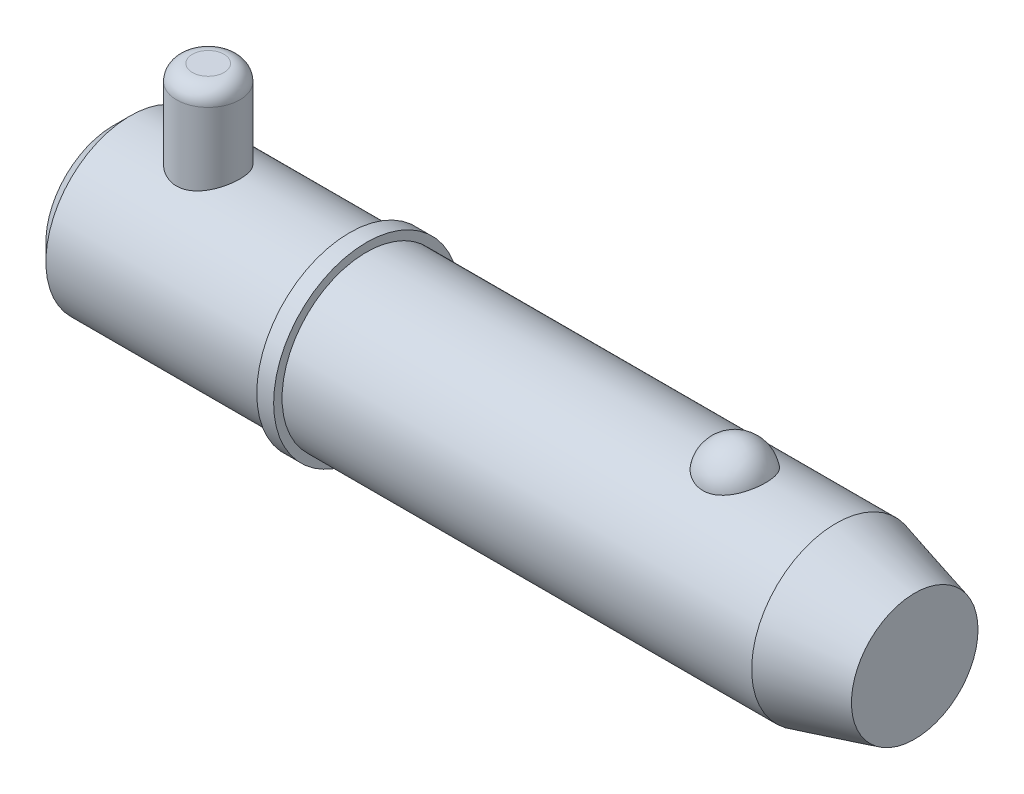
ISO-10303-21;
HEADER;
FILE_DESCRIPTION(('STEP AP214'),'2;1');
FILE_NAME('part.step','',(''),(''),'','','');
FILE_SCHEMA(('AUTOMOTIVE_DESIGN { 1 0 10303 214 1 1 1 1 }'));
ENDSEC;
DATA;
#1=APPLICATION_CONTEXT('core data for automotive mechanical design processes');
#2=APPLICATION_PROTOCOL_DEFINITION('international standard','automotive_design',2000,#1);
#3=PRODUCT_CONTEXT('',#1,'mechanical');
#4=PRODUCT('Part','Part','',(#3));
#5=PRODUCT_RELATED_PRODUCT_CATEGORY('part','',(#4));
#6=PRODUCT_DEFINITION_FORMATION('','',#4);
#7=PRODUCT_DEFINITION_CONTEXT('part definition',#1,'design');
#8=PRODUCT_DEFINITION('design','',#6,#7);
#9=PRODUCT_DEFINITION_SHAPE('','',#8);
#10=(LENGTH_UNIT() NAMED_UNIT(*) SI_UNIT(.MILLI.,.METRE.));
#11=(NAMED_UNIT(*) PLANE_ANGLE_UNIT() SI_UNIT($,.RADIAN.));
#12=(NAMED_UNIT(*) SI_UNIT($,.STERADIAN.) SOLID_ANGLE_UNIT());
#13=UNCERTAINTY_MEASURE_WITH_UNIT(LENGTH_MEASURE(1.E-05),#10,'distance_accuracy_value','');
#14=(GEOMETRIC_REPRESENTATION_CONTEXT(3) GLOBAL_UNCERTAINTY_ASSIGNED_CONTEXT((#13)) GLOBAL_UNIT_ASSIGNED_CONTEXT((#10,
#11,#12)) REPRESENTATION_CONTEXT('',''));
#15=CARTESIAN_POINT('',(0.,0.,0.));
#16=DIRECTION('',(0.,0.,1.));
#17=DIRECTION('',(1.,0.,0.));
#18=AXIS2_PLACEMENT_3D('',#15,#16,#17);
#19=CARTESIAN_POINT('',(14.28,25.4,0.));
#20=DIRECTION('',(0.,-1.,0.));
#21=DIRECTION('',(0.,0.,-1.));
#22=AXIS2_PLACEMENT_3D('',#19,#20,#21);
#23=CYLINDRICAL_SURFACE('',#22,4.76);
#24=CARTESIAN_POINT('',(14.28,-10.32,0.));
#25=DIRECTION('',(0.,1.,0.));
#26=DIRECTION('',(0.,0.,1.));
#27=AXIS2_PLACEMENT_3D('',#24,#25,#26);
#28=CIRCLE('',#27,4.76);
#29=CARTESIAN_POINT('',(14.28,-10.32,-4.76));
#30=VERTEX_POINT('',#29);
#31=EDGE_CURVE('P0_E25',#30,#30,#28,.T.);
#32=CARTESIAN_POINT('',(14.28,23.02,0.));
#33=DIRECTION('',(0.,1.,0.));
#34=DIRECTION('',(0.,0.,1.));
#35=AXIS2_PLACEMENT_3D('',#32,#33,#34);
#36=CIRCLE('',#35,4.76);
#37=CARTESIAN_POINT('',(14.28,23.02,-4.76));
#38=VERTEX_POINT('',#37);
#39=EDGE_CURVE('P0_E29',#38,#38,#36,.F.);
#40=CARTESIAN_POINT('',(14.28,-10.32,-4.76));
#41=CARTESIAN_POINT('',(14.28,-9.97270833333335,-4.76));
#42=CARTESIAN_POINT('',(14.28,-9.62541666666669,-4.76));
#43=CARTESIAN_POINT('',(14.28,-8.93083333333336,-4.76));
#44=CARTESIAN_POINT('',(14.28,-8.58354166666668,-4.76));
#45=CARTESIAN_POINT('',(14.28,-7.88895833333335,-4.76));
#46=CARTESIAN_POINT('',(14.28,-7.54166666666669,-4.76));
#47=CARTESIAN_POINT('',(14.28,-6.84708333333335,-4.76));
#48=CARTESIAN_POINT('',(14.28,-6.49979166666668,-4.76));
#49=CARTESIAN_POINT('',(14.28,-5.80520833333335,-4.76));
#50=CARTESIAN_POINT('',(14.28,-5.45791666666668,-4.76));
#51=CARTESIAN_POINT('',(14.28,-4.76333333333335,-4.76));
#52=CARTESIAN_POINT('',(14.28,-4.41604166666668,-4.76));
#53=CARTESIAN_POINT('',(14.28,-3.72145833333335,-4.76));
#54=CARTESIAN_POINT('',(14.28,-3.37416666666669,-4.76));
#55=CARTESIAN_POINT('',(14.28,-2.67958333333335,-4.76));
#56=CARTESIAN_POINT('',(14.28,-2.33229166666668,-4.76));
#57=CARTESIAN_POINT('',(14.28,-1.63770833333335,-4.76));
#58=CARTESIAN_POINT('',(14.28,-1.29041666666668,-4.76));
#59=CARTESIAN_POINT('',(14.28,-0.595833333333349,-4.76));
#60=CARTESIAN_POINT('',(14.28,-0.24854166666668,-4.76));
#61=CARTESIAN_POINT('',(14.28,0.446041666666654,-4.76));
#62=CARTESIAN_POINT('',(14.28,0.793333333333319,-4.76));
#63=CARTESIAN_POINT('',(14.28,1.48791666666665,-4.76));
#64=CARTESIAN_POINT('',(14.28,1.83520833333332,-4.76));
#65=CARTESIAN_POINT('',(14.28,2.52979166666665,-4.76));
#66=CARTESIAN_POINT('',(14.28,2.87708333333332,-4.76));
#67=CARTESIAN_POINT('',(14.28,3.57166666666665,-4.76));
#68=CARTESIAN_POINT('',(14.28,3.91895833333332,-4.76));
#69=CARTESIAN_POINT('',(14.28,4.61354166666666,-4.76));
#70=CARTESIAN_POINT('',(14.28,4.96083333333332,-4.76));
#71=CARTESIAN_POINT('',(14.28,5.65541666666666,-4.76));
#72=CARTESIAN_POINT('',(14.28,6.00270833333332,-4.76));
#73=CARTESIAN_POINT('',(14.28,6.69729166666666,-4.76));
#74=CARTESIAN_POINT('',(14.28,7.04458333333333,-4.76));
#75=CARTESIAN_POINT('',(14.28,7.73916666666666,-4.76));
#76=CARTESIAN_POINT('',(14.28,8.08645833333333,-4.76));
#77=CARTESIAN_POINT('',(14.28,8.78104166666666,-4.76));
#78=CARTESIAN_POINT('',(14.28,9.12833333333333,-4.76));
#79=CARTESIAN_POINT('',(14.28,9.82291666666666,-4.76));
#80=CARTESIAN_POINT('',(14.28,10.1702083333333,-4.76));
#81=CARTESIAN_POINT('',(14.28,10.8647916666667,-4.76));
#82=CARTESIAN_POINT('',(14.28,11.2120833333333,-4.76));
#83=CARTESIAN_POINT('',(14.28,11.9066666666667,-4.76));
#84=CARTESIAN_POINT('',(14.28,12.2539583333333,-4.76));
#85=CARTESIAN_POINT('',(14.28,12.9485416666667,-4.76));
#86=CARTESIAN_POINT('',(14.28,13.2958333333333,-4.76));
#87=CARTESIAN_POINT('',(14.28,13.9904166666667,-4.76));
#88=CARTESIAN_POINT('',(14.28,14.3377083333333,-4.76));
#89=CARTESIAN_POINT('',(14.28,15.0322916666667,-4.76));
#90=CARTESIAN_POINT('',(14.28,15.3795833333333,-4.76));
#91=CARTESIAN_POINT('',(14.28,16.0741666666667,-4.76));
#92=CARTESIAN_POINT('',(14.28,16.4214583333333,-4.76));
#93=CARTESIAN_POINT('',(14.28,17.1160416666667,-4.76));
#94=CARTESIAN_POINT('',(14.28,17.4633333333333,-4.76));
#95=CARTESIAN_POINT('',(14.28,18.1579166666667,-4.76));
#96=CARTESIAN_POINT('',(14.28,18.5052083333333,-4.76));
#97=CARTESIAN_POINT('',(14.28,19.1997916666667,-4.76));
#98=CARTESIAN_POINT('',(14.28,19.5470833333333,-4.76));
#99=CARTESIAN_POINT('',(14.28,20.2416666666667,-4.76));
#100=CARTESIAN_POINT('',(14.28,20.5889583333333,-4.76));
#101=CARTESIAN_POINT('',(14.28,21.2835416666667,-4.76));
#102=CARTESIAN_POINT('',(14.28,21.6308333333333,-4.76));
#103=CARTESIAN_POINT('',(14.28,22.3254166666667,-4.76));
#104=CARTESIAN_POINT('',(14.28,22.6727083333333,-4.76));
#105=CARTESIAN_POINT('',(14.28,23.02,-4.76));
#106=B_SPLINE_CURVE_WITH_KNOTS('',3,(#40,#41,#42,#43,#44,#45,#46,#47,#48,#49,#50,#51,#52,#53,
#54,#55,#56,#57,#58,#59,#60,#61,#62,#63,#64,#65,#66,#67,#68,#69,#70,#71,#72,#73,#74,#75,#76,#77,
#78,#79,#80,#81,#82,#83,#84,#85,#86,#87,#88,#89,#90,#91,#92,#93,#94,#95,#96,#97,#98,#99,#100,
#101,#102,#103,#104,#105),.UNSPECIFIED.,.F.,.F.,(4,2,2,2,2,2,2,2,2,2,2,2,2,2,2,2,2,2,2,2,2,2,2,
2,2,2,2,2,2,2,2,2,4),(0.,1.041875,2.08375,3.125625,4.1675,5.209375,6.25125,7.293125,
8.33500000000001,9.376875,10.41875,11.460625,12.5025,13.544375,14.58625,15.628125,16.67,
17.711875,18.75375,19.795625,20.8375,21.879375,22.92125,23.963125,25.005,26.046875,27.08875,
28.130625,29.1725,30.214375,31.25625,32.298125,33.34),.UNSPECIFIED.);
#107=EDGE_CURVE('P0_BSEAM14',#30,#38,#106,.T.);
#108=ORIENTED_EDGE('',*,*,#31,.T.);
#109=ORIENTED_EDGE('',*,*,#39,.T.);
#110=ORIENTED_EDGE('',*,*,#107,.T.);
#111=ORIENTED_EDGE('',*,*,#107,.F.);
#112=EDGE_LOOP('',(#108,#110,#109,#111));
#113=FACE_BOUND('',#112,.T.);
#114=ADVANCED_FACE('P0_F14',(#113),#23,.T.);
#115=CARTESIAN_POINT('',(14.28,25.4,0.));
#116=DIRECTION('',(0.,1.,0.));
#117=DIRECTION('',(0.,0.,1.));
#118=AXIS2_PLACEMENT_3D('',#115,#116,#117);
#119=PLANE('',#118);
#120=CARTESIAN_POINT('',(14.28,25.4,0.));
#121=DIRECTION('',(0.,1.,0.));
#122=DIRECTION('',(0.,0.,1.));
#123=AXIS2_PLACEMENT_3D('',#120,#121,#122);
#124=CIRCLE('',#123,2.38);
#125=CARTESIAN_POINT('',(14.28,25.4,2.38));
#126=VERTEX_POINT('',#125);
#127=EDGE_CURVE('P0_E10',#126,#126,#124,.T.);
#128=ORIENTED_EDGE('',*,*,#127,.T.);
#129=EDGE_LOOP('',(#128));
#130=FACE_BOUND('',#129,.T.);
#131=ADVANCED_FACE('P0_F46',(#130),#119,.T.);
#132=CARTESIAN_POINT('',(14.28,-12.7,0.));
#133=DIRECTION('',(0.,1.,0.));
#134=DIRECTION('',(0.,0.,1.));
#135=AXIS2_PLACEMENT_3D('',#132,#133,#134);
#136=PLANE('',#135);
#137=CARTESIAN_POINT('',(14.28,-12.7,0.));
#138=DIRECTION('',(0.,1.,0.));
#139=DIRECTION('',(0.,0.,1.));
#140=AXIS2_PLACEMENT_3D('',#137,#138,#139);
#141=CIRCLE('',#140,2.38);
#142=CARTESIAN_POINT('',(14.28,-12.7,2.38));
#143=VERTEX_POINT('',#142);
#144=EDGE_CURVE('P0_E21',#143,#143,#141,.F.);
#145=ORIENTED_EDGE('',*,*,#144,.T.);
#146=EDGE_LOOP('',(#145));
#147=FACE_BOUND('',#146,.T.);
#148=ADVANCED_FACE('P0_F43',(#147),#136,.F.);
#149=CARTESIAN_POINT('',(14.28,-10.32,0.));
#150=DIRECTION('',(0.,1.,0.));
#151=DIRECTION('',(0.,0.,1.));
#152=AXIS2_PLACEMENT_3D('',#149,#150,#151);
#153=DEGENERATE_TOROIDAL_SURFACE('',#152,2.38,2.38,.T.);
#154=ORIENTED_EDGE('',*,*,#144,.F.);
#155=EDGE_LOOP('',(#154));
#156=FACE_BOUND('',#155,.T.);
#157=ORIENTED_EDGE('',*,*,#31,.F.);
#158=EDGE_LOOP('',(#157));
#159=FACE_BOUND('',#158,.T.);
#160=ADVANCED_FACE('P0_F38',(#156,#159),#153,.T.);
#161=CARTESIAN_POINT('',(14.28,23.02,0.));
#162=DIRECTION('',(0.,1.,0.));
#163=DIRECTION('',(0.,0.,1.));
#164=AXIS2_PLACEMENT_3D('',#161,#162,#163);
#165=DEGENERATE_TOROIDAL_SURFACE('',#164,2.38,2.38,.T.);
#166=ORIENTED_EDGE('',*,*,#39,.F.);
#167=EDGE_LOOP('',(#166));
#168=FACE_BOUND('',#167,.T.);
#169=ORIENTED_EDGE('',*,*,#127,.F.);
#170=EDGE_LOOP('',(#169));
#171=FACE_BOUND('',#170,.T.);
#172=ADVANCED_FACE('P0_F16',(#168,#171),#165,.T.);
#173=CLOSED_SHELL('',(#114,#131,#148,#160,#172));
#174=MANIFOLD_SOLID_BREP('P0_B1',#173);
#175=CARTESIAN_POINT('',(0.,0.,0.));
#176=DIRECTION('',(1.,0.,0.));
#177=DIRECTION('',(0.,0.,-1.));
#178=AXIS2_PLACEMENT_3D('',#175,#176,#177);
#179=CYLINDRICAL_SURFACE('',#178,12.7);
#180=CARTESIAN_POINT('',(108.800738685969,0.,0.));
#181=DIRECTION('',(1.,0.,0.));
#182=DIRECTION('',(0.,0.,-1.));
#183=AXIS2_PLACEMENT_3D('',#180,#181,#182);
#184=CIRCLE('',#183,12.7);
#185=CARTESIAN_POINT('',(108.800738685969,0.,-12.7));
#186=VERTEX_POINT('',#185);
#187=EDGE_CURVE('P1_E81',#186,#186,#184,.T.);
#188=ORIENTED_EDGE('',*,*,#187,.F.);
#189=EDGE_LOOP('',(#188));
#190=FACE_BOUND('',#189,.T.);
#191=CARTESIAN_POINT('',(38.1,0.,0.));
#192=DIRECTION('',(1.,0.,0.));
#193=DIRECTION('',(0.,0.,-1.));
#194=AXIS2_PLACEMENT_3D('',#191,#192,#193);
#195=CIRCLE('',#194,12.7);
#196=CARTESIAN_POINT('',(38.1,0.,-12.7));
#197=VERTEX_POINT('',#196);
#198=EDGE_CURVE('P1_E85',#197,#197,#195,.T.);
#199=ORIENTED_EDGE('',*,*,#198,.T.);
#200=EDGE_LOOP('',(#199));
#201=FACE_BOUND('',#200,.T.);
#202=CARTESIAN_POINT('',(93.5600429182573,11.7500437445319,4.81938502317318));
#203=CARTESIAN_POINT('',(93.4350881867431,11.7500430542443,4.81938571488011));
#204=CARTESIAN_POINT('',(93.310144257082,11.7520975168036,4.81438658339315));
#205=CARTESIAN_POINT('',(93.0611425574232,11.760253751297,4.79442904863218));
#206=CARTESIAN_POINT('',(92.9370850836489,11.7663568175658,4.77946746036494));
#207=CARTESIAN_POINT('',(92.6909016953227,11.7824262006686,4.7397141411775));
#208=CARTESIAN_POINT('',(92.5687744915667,11.7923898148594,4.71492928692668));
#209=CARTESIAN_POINT('',(92.3271874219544,11.8158938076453,4.65571340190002));
#210=CARTESIAN_POINT('',(92.2077285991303,11.8294355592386,4.6212786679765));
#211=CARTESIAN_POINT('',(91.9725578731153,11.8596812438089,4.54309502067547));
#212=CARTESIAN_POINT('',(91.8568393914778,11.8763792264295,4.49936361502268));
#213=CARTESIAN_POINT('',(91.6296530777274,11.9124878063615,4.40287235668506));
#214=CARTESIAN_POINT('',(91.5181868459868,11.9318994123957,4.35010914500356));
#215=CARTESIAN_POINT('',(91.1912782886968,11.9934256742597,4.17881316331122));
#216=CARTESIAN_POINT('',(90.9831270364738,12.038858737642,4.04720756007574));
#217=CARTESIAN_POINT('',(90.5858509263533,12.1352173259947,3.748564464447));
#218=CARTESIAN_POINT('',(90.3974438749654,12.1862630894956,3.58061821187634));
#219=CARTESIAN_POINT('',(90.0505213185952,12.2875163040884,3.21600758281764));
#220=CARTESIAN_POINT('',(89.8920113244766,12.3377235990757,3.0193379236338));
#221=CARTESIAN_POINT('',(89.6016887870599,12.434492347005,2.592916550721));
#222=CARTESIAN_POINT('',(89.4713762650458,12.4807925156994,2.36208286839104));
#223=CARTESIAN_POINT('',(89.2494079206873,12.5623454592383,1.88070399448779));
#224=CARTESIAN_POINT('',(89.1577554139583,12.5975972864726,1.63015711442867));
#225=CARTESIAN_POINT('',(89.0140466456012,12.6538414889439,1.1129886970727));
#226=CARTESIAN_POINT('',(88.9624990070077,12.6746503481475,0.846205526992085));
#227=CARTESIAN_POINT('',(88.9019771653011,12.699153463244,0.307085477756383));
#228=CARTESIAN_POINT('',(88.8930018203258,12.7028481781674,0.0347487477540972));
#229=CARTESIAN_POINT('',(88.9177310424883,12.6927785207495,-0.506073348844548));
#230=CARTESIAN_POINT('',(88.9511899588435,12.6791146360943,-0.77457186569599));
#231=CARTESIAN_POINT('',(89.0596877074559,12.635882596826,-1.30170246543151));
#232=CARTESIAN_POINT('',(89.1347272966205,12.606314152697,-1.5603343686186));
#233=CARTESIAN_POINT('',(89.3250000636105,12.5342328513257,-2.06083899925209));
#234=CARTESIAN_POINT('',(89.4402872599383,12.4917026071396,-2.3026886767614));
#235=CARTESIAN_POINT('',(89.7087044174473,12.3981123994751,-2.76259600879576));
#236=CARTESIAN_POINT('',(89.8618374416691,12.3470517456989,-2.98065173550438));
#237=CARTESIAN_POINT('',(90.2035077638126,12.2416045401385,-3.38786328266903));
#238=CARTESIAN_POINT('',(90.3922017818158,12.1872040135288,-3.57688418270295));
#239=CARTESIAN_POINT('',(90.8002392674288,12.0814086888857,-3.91941073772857));
#240=CARTESIAN_POINT('',(91.0195800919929,12.0300136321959,-4.07291945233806));
#241=CARTESIAN_POINT('',(91.4783753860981,11.9373542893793,-4.33691289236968));
#242=CARTESIAN_POINT('',(91.7173044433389,11.8958982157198,-4.44824125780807));
#243=CARTESIAN_POINT('',(92.2124376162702,11.8268116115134,-4.62881985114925));
#244=CARTESIAN_POINT('',(92.4686351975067,11.7991758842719,-4.69808589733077));
#245=CARTESIAN_POINT('',(92.9771640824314,11.7622209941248,-4.78983181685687));
#246=CARTESIAN_POINT('',(93.2290414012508,11.7520502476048,-4.81449025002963));
#247=CARTESIAN_POINT('',(93.7335734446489,11.7485796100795,-4.82295735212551));
#248=CARTESIAN_POINT('',(93.9862280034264,11.7552763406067,-4.80677420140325));
#249=CARTESIAN_POINT('',(94.4768341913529,11.7842584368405,-4.73525430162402));
#250=CARTESIAN_POINT('',(94.7149984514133,11.8060486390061,-4.68116061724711));
#251=CARTESIAN_POINT('',(95.1784894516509,11.8622750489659,-4.53678133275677));
#252=CARTESIAN_POINT('',(95.4038151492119,11.8967122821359,-4.44649279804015));
#253=CARTESIAN_POINT('',(95.8408018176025,11.9754603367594,-4.2298761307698));
#254=CARTESIAN_POINT('',(96.0520579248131,12.0199699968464,-4.10280539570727));
#255=CARTESIAN_POINT('',(96.4506012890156,12.1138028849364,-3.81685409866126));
#256=CARTESIAN_POINT('',(96.6378830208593,12.163127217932,-3.65796622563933));
#257=CARTESIAN_POINT('',(96.9933509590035,12.2642343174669,-3.30364864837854));
#258=CARTESIAN_POINT('',(97.1601119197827,12.3160165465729,-3.10678783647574));
#259=CARTESIAN_POINT('',(97.4595799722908,12.4142566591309,-2.68748409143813));
#260=CARTESIAN_POINT('',(97.5922809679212,12.4607135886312,-2.46503658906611));
#261=CARTESIAN_POINT('',(97.8246912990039,12.5450236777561,-1.99289519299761));
#262=CARTESIAN_POINT('',(97.923215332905,12.5825557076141,-1.74255918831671));
#263=CARTESIAN_POINT('',(98.0792277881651,12.6431720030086,-1.22773734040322));
#264=CARTESIAN_POINT('',(98.1367157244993,12.6662560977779,-0.963251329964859));
#265=CARTESIAN_POINT('',(98.2095441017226,12.6956486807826,-0.427355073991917));
#266=CARTESIAN_POINT('',(98.2248378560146,12.7019385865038,-0.1559374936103));
#267=CARTESIAN_POINT('',(98.2127794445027,12.6970201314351,0.385928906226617));
#268=CARTESIAN_POINT('',(98.1854280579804,12.6858120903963,0.656377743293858));
#269=CARTESIAN_POINT('',(98.1130609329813,12.6568455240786,1.05454017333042));
#270=CARTESIAN_POINT('',(98.0837963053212,12.6451962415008,1.18577850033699));
#271=CARTESIAN_POINT('',(98.0150228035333,12.6181819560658,1.4451380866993));
#272=CARTESIAN_POINT('',(97.9755176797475,12.6028183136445,1.57326046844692));
#273=CARTESIAN_POINT('',(97.8864397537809,12.5687547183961,1.82554978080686));
#274=CARTESIAN_POINT('',(97.8368627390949,12.5500533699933,1.9497150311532));
#275=CARTESIAN_POINT('',(97.7279211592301,12.5098093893,2.1931437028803));
#276=CARTESIAN_POINT('',(97.6685601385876,12.4882677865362,2.31240887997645));
#277=CARTESIAN_POINT('',(97.5399712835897,12.4427679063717,2.54593031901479));
#278=CARTESIAN_POINT('',(97.4706888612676,12.4187964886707,2.66015396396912));
#279=CARTESIAN_POINT('',(97.322903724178,12.3691892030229,2.88202659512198));
#280=CARTESIAN_POINT('',(97.2444044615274,12.3435539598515,2.98967802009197));
#281=CARTESIAN_POINT('',(97.0785502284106,12.2912955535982,3.19774385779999));
#282=CARTESIAN_POINT('',(96.9911918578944,12.2646720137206,3.29815546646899));
#283=CARTESIAN_POINT('',(96.8081617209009,12.2111945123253,3.49095035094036));
#284=CARTESIAN_POINT('',(96.7124932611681,12.1843406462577,3.58333679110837));
#285=CARTESIAN_POINT('',(96.5136272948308,12.1312249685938,3.75922876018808));
#286=CARTESIAN_POINT('',(96.4104503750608,12.104961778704,3.84275713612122));
#287=CARTESIAN_POINT('',(96.1970133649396,12.0537284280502,4.00056406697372));
#288=CARTESIAN_POINT('',(96.0867562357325,12.028757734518,4.07484645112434));
#289=CARTESIAN_POINT('',(95.8597550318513,11.9808306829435,4.21367959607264));
#290=CARTESIAN_POINT('',(95.7430068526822,11.9578756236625,4.27822410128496));
#291=CARTESIAN_POINT('',(95.5039425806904,11.9147184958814,4.39698483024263));
#292=CARTESIAN_POINT('',(95.3816287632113,11.894515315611,4.45120522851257));
#293=CARTESIAN_POINT('',(95.122952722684,11.8561129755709,4.55255353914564));
#294=CARTESIAN_POINT('',(94.9862237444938,11.8381764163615,4.59884858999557));
#295=CARTESIAN_POINT('',(94.7086087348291,11.8069093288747,4.67853897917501));
#296=CARTESIAN_POINT('',(94.5677245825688,11.7935767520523,4.71194005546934));
#297=CARTESIAN_POINT('',(94.2830944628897,11.7720277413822,4.76552188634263));
#298=CARTESIAN_POINT('',(94.1393488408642,11.7638106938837,4.78570422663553));
#299=CARTESIAN_POINT('',(93.8504114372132,11.7528195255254,4.81263433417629));
#300=CARTESIAN_POINT('',(93.7052198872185,11.7500445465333,4.81938421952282));
#301=CARTESIAN_POINT('',(93.5600429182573,11.7500437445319,4.81938502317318));
#302=B_SPLINE_CURVE_WITH_KNOTS('',3,(#202,#203,#204,#205,#206,#207,#208,#209,#210,#211,#212,
#213,#214,#215,#216,#217,#218,#219,#220,#221,#222,#223,#224,#225,#226,#227,#228,#229,#230,#231,
#232,#233,#234,#235,#236,#237,#238,#239,#240,#241,#242,#243,#244,#245,#246,#247,#248,#249,#250,
#251,#252,#253,#254,#255,#256,#257,#258,#259,#260,#261,#262,#263,#264,#265,#266,#267,#268,#269,
#270,#271,#272,#273,#274,#275,#276,#277,#278,#279,#280,#281,#282,#283,#284,#285,#286,#287,#288,
#289,#290,#291,#292,#293,#294,#295,#296,#297,#298,#299,#300,#301),.UNSPECIFIED.,.T.,.F.,(4,2,2,
2,2,2,2,2,2,2,2,2,2,2,2,2,2,2,2,2,2,2,2,2,2,2,2,2,2,2,2,2,2,2,2,2,2,2,2,2,2,2,2,2,2,2,2,2,2,4),
(0.,0.374729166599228,0.749578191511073,1.12416526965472,1.49889629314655,1.87292776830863,
2.24709865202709,2.99481328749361,3.76399449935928,4.53331735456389,5.3368391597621,
6.14042986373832,6.95405296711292,7.76765424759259,8.57656703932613,9.38549455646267,
10.1955119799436,11.0055949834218,11.8193353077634,12.6330054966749,13.4294141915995,
14.2255231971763,14.9815786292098,15.7374826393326,16.4696948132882,17.2019663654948,
17.9501979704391,18.6986017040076,19.484470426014,20.2704797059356,21.0815215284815,
21.8925729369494,22.7045213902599,23.5164550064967,23.9209608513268,24.3253187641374,
24.7298461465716,25.1342272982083,25.54092555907,25.9474719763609,26.3541750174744,
26.7607169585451,27.1661834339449,27.5714814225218,27.9770386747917,28.3824315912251,
28.8181206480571,29.2536155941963,29.6890582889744,30.1244323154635),.UNSPECIFIED.);
#303=CARTESIAN_POINT('',(93.5600429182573,11.7500437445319,4.81938502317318));
#304=VERTEX_POINT('',#303);
#305=EDGE_CURVE('P1_E35',#304,#304,#302,.T.);
#306=ORIENTED_EDGE('',*,*,#305,.T.);
#307=EDGE_LOOP('',(#306));
#308=FACE_BOUND('',#307,.T.);
#309=ADVANCED_FACE('P1_F13',(#190,#201,#308),#179,.T.);
#310=CARTESIAN_POINT('',(0.,0.,0.));
#311=DIRECTION('',(-1.,0.,0.));
#312=DIRECTION('',(0.,0.,1.));
#313=AXIS2_PLACEMENT_3D('',#310,#311,#312);
#314=PLANE('',#313);
#315=CARTESIAN_POINT('',(0.,0.,0.));
#316=DIRECTION('',(1.,0.,0.));
#317=DIRECTION('',(0.,0.,-1.));
#318=AXIS2_PLACEMENT_3D('',#315,#316,#317);
#319=CIRCLE('',#318,10.16);
#320=CARTESIAN_POINT('',(0.,0.,-10.16));
#321=VERTEX_POINT('',#320);
#322=EDGE_CURVE('P1_E9',#321,#321,#319,.T.);
#323=ORIENTED_EDGE('',*,*,#322,.F.);
#324=EDGE_LOOP('',(#323));
#325=FACE_BOUND('',#324,.T.);
#326=ADVANCED_FACE('P1_F15',(#325),#314,.T.);
#327=CARTESIAN_POINT('',(2.53999999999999,0.,0.));
#328=DIRECTION('',(1.,0.,0.));
#329=DIRECTION('',(0.,0.,-1.));
#330=AXIS2_PLACEMENT_3D('',#327,#328,#329);
#331=CONICAL_SURFACE('',#330,12.7,0.78539816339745);
#332=ORIENTED_EDGE('',*,*,#322,.T.);
#333=EDGE_LOOP('',(#332));
#334=FACE_BOUND('',#333,.T.);
#335=CARTESIAN_POINT('',(2.53999999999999,0.,0.));
#336=DIRECTION('',(1.,0.,0.));
#337=DIRECTION('',(0.,0.,-1.));
#338=AXIS2_PLACEMENT_3D('',#335,#336,#337);
#339=CIRCLE('',#338,12.7);
#340=CARTESIAN_POINT('',(2.53999999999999,0.,-12.7));
#341=VERTEX_POINT('',#340);
#342=EDGE_CURVE('P1_E26',#341,#341,#339,.T.);
#343=ORIENTED_EDGE('',*,*,#342,.F.);
#344=EDGE_LOOP('',(#343));
#345=FACE_BOUND('',#344,.T.);
#346=ADVANCED_FACE('P1_F77',(#334,#345),#331,.T.);
#347=CARTESIAN_POINT('',(0.,0.,0.));
#348=DIRECTION('',(1.,0.,0.));
#349=DIRECTION('',(0.,0.,-1.));
#350=AXIS2_PLACEMENT_3D('',#347,#348,#349);
#351=CYLINDRICAL_SURFACE('',#350,12.7);
#352=CARTESIAN_POINT('',(14.28,-11.7742260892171,4.76));
#353=CARTESIAN_POINT('',(14.1514948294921,-11.7742255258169,4.76000061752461));
#354=CARTESIAN_POINT('',(14.0229980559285,-11.7763355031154,4.75479194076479));
#355=CARTESIAN_POINT('',(13.7669369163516,-11.7847043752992,4.73401198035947));
#356=CARTESIAN_POINT('',(13.6393728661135,-11.7909646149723,4.71843733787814));
#357=CARTESIAN_POINT('',(13.386226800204,-11.8074248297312,4.67709434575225));
#358=CARTESIAN_POINT('',(13.2606439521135,-11.8176231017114,4.65133040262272));
#359=CARTESIAN_POINT('',(13.0122434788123,-11.8416347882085,4.58985545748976));
#360=CARTESIAN_POINT('',(12.8894269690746,-11.8554496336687,4.55414051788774));
#361=CARTESIAN_POINT('',(12.6477622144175,-11.8862222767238,4.47320764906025));
#362=CARTESIAN_POINT('',(12.5289037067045,-11.9031710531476,4.4280169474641));
#363=CARTESIAN_POINT('',(12.2955059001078,-11.939736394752,4.32845291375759));
#364=CARTESIAN_POINT('',(12.1809682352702,-11.9593539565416,4.2740761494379));
#365=CARTESIAN_POINT('',(11.8448901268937,-12.0213893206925,4.09777237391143));
#366=CARTESIAN_POINT('',(11.6307077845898,-12.0670135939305,3.9626122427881));
#367=CARTESIAN_POINT('',(11.2179129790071,-12.1641514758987,3.65386230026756));
#368=CARTESIAN_POINT('',(11.0204399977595,-12.2158379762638,3.47881300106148));
#369=CARTESIAN_POINT('',(10.6568212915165,-12.3178468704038,3.09829182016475));
#370=CARTESIAN_POINT('',(10.4906822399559,-12.3681689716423,2.89281347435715));
#371=CARTESIAN_POINT('',(10.1890299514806,-12.4638367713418,2.44867909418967));
#372=CARTESIAN_POINT('',(10.054749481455,-12.5089552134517,2.20913281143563));
#373=CARTESIAN_POINT('',(9.82886079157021,-12.5870472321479,1.70885919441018));
#374=CARTESIAN_POINT('',(9.73723778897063,-12.620025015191,1.44813923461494));
#375=CARTESIAN_POINT('',(9.60324488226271,-12.6688874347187,0.9248423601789));
#376=CARTESIAN_POINT('',(9.55892269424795,-12.6854474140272,0.662829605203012));
#377=CARTESIAN_POINT('',(9.5145335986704,-12.7020320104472,0.134596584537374));
#378=CARTESIAN_POINT('',(9.5144523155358,-12.7020619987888,-0.131622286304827));
#379=CARTESIAN_POINT('',(9.55741019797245,-12.6860129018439,-0.646717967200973));
#380=CARTESIAN_POINT('',(9.59831845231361,-12.6707298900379,-0.895801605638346));
#381=CARTESIAN_POINT('',(9.71850987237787,-12.6268158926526,-1.38327219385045));
#382=CARTESIAN_POINT('',(9.79779575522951,-12.5981839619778,-1.62165838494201));
#383=CARTESIAN_POINT('',(9.99348296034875,-12.5298894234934,-2.08508424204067));
#384=CARTESIAN_POINT('',(10.110407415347,-12.4900724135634,-2.30987931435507));
#385=CARTESIAN_POINT('',(10.3775896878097,-12.4034373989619,-2.7372158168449));
#386=CARTESIAN_POINT('',(10.5278582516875,-12.3566171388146,-2.93975004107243));
#387=CARTESIAN_POINT('',(10.8677318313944,-12.257571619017,-3.32936830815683));
#388=CARTESIAN_POINT('',(11.0591227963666,-12.2051903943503,-3.51485714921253));
#389=CARTESIAN_POINT('',(11.4706087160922,-12.1031155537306,-3.85170663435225));
#390=CARTESIAN_POINT('',(11.6907108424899,-12.0534226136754,-4.00305872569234));
#391=CARTESIAN_POINT('',(12.1596597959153,-11.9613684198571,-4.27038218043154));
#392=CARTESIAN_POINT('',(12.4090353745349,-11.9191939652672,-4.38549550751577));
#393=CARTESIAN_POINT('',(12.9256290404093,-11.8491124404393,-4.57149117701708));
#394=CARTESIAN_POINT('',(13.1928371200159,-11.8211974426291,-4.64239810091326));
#395=CARTESIAN_POINT('',(13.7217488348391,-11.7846654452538,-4.73434137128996));
#396=CARTESIAN_POINT('',(13.9829438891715,-11.7750694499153,-4.75791141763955));
#397=CARTESIAN_POINT('',(14.5056760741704,-11.7734909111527,-4.76182097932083));
#398=CARTESIAN_POINT('',(14.7672131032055,-11.7815039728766,-4.74217128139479));
#399=CARTESIAN_POINT('',(15.2702140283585,-11.8132466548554,-4.66249544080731));
#400=CARTESIAN_POINT('',(15.5120417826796,-11.8362133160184,-4.60442726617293));
#401=CARTESIAN_POINT('',(15.9824097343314,-11.8943704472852,-4.45202868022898));
#402=CARTESIAN_POINT('',(16.2109472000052,-11.9295634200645,-4.35769084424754));
#403=CARTESIAN_POINT('',(16.6577741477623,-12.0098310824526,-4.13144368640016));
#404=CARTESIAN_POINT('',(16.8753590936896,-12.055226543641,-3.99825937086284));
#405=CARTESIAN_POINT('',(17.2859732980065,-12.150238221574,-3.69949845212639));
#406=CARTESIAN_POINT('',(17.4789935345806,-12.19985597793,-3.5339100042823));
#407=CARTESIAN_POINT('',(17.8477707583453,-12.3015434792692,-3.1624728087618));
#408=CARTESIAN_POINT('',(18.0216609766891,-12.3535695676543,-2.95473880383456));
#409=CARTESIAN_POINT('',(18.254545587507,-12.426745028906,-2.62277433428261));
#410=CARTESIAN_POINT('',(18.3275489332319,-12.4503382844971,-2.50865480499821));
#411=CARTESIAN_POINT('',(18.463723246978,-12.4952713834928,-2.27428971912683));
#412=CARTESIAN_POINT('',(18.5268984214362,-12.5166121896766,-2.15404681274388));
#413=CARTESIAN_POINT('',(18.6427140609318,-12.5563817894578,-1.90858448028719));
#414=CARTESIAN_POINT('',(18.6953855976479,-12.5748191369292,-1.78338108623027));
#415=CARTESIAN_POINT('',(18.7899337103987,-12.6083284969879,-1.52857834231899));
#416=CARTESIAN_POINT('',(18.8318147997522,-12.6234019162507,-1.39898085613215));
#417=CARTESIAN_POINT('',(18.9043819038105,-12.6497495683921,-1.13633254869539));
#418=CARTESIAN_POINT('',(18.9350698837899,-12.6610244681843,-1.00328233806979));
#419=CARTESIAN_POINT('',(18.9849303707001,-12.6794412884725,-0.734761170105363));
#420=CARTESIAN_POINT('',(19.0041035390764,-12.6865834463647,-0.59929035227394));
#421=CARTESIAN_POINT('',(19.0299427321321,-12.6962286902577,-0.335006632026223));
#422=CARTESIAN_POINT('',(19.0372742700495,-12.698978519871,-0.206267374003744));
#423=CARTESIAN_POINT('',(19.0414668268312,-12.7005496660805,0.0514515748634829));
#424=CARTESIAN_POINT('',(19.038324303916,-12.69936965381,0.180431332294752));
#425=CARTESIAN_POINT('',(19.0215965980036,-12.6931114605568,0.437551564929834));
#426=CARTESIAN_POINT('',(19.0080165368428,-12.6880351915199,0.565692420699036));
#427=CARTESIAN_POINT('',(18.9705519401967,-12.6741222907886,0.820297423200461));
#428=CARTESIAN_POINT('',(18.9466635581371,-12.665284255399,0.946760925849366));
#429=CARTESIAN_POINT('',(18.8895279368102,-12.6443449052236,1.19395899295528));
#430=CARTESIAN_POINT('',(18.8565273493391,-12.6323299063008,1.3147578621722));
#431=CARTESIAN_POINT('',(18.781239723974,-12.6052503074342,1.55308888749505));
#432=CARTESIAN_POINT('',(18.738949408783,-12.5901846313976,1.67061987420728));
#433=CARTESIAN_POINT('',(18.5986461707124,-12.5409473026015,2.01714406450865));
#434=CARTESIAN_POINT('',(18.4871532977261,-12.502717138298,2.24027279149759));
#435=CARTESIAN_POINT('',(18.2262440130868,-12.4173042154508,2.6742599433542));
#436=CARTESIAN_POINT('',(18.0754310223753,-12.3698127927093,2.88420891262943));
#437=CARTESIAN_POINT('',(17.7421836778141,-12.271667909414,3.27675114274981));
#438=CARTESIAN_POINT('',(17.5597380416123,-12.2210133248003,3.45933459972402));
#439=CARTESIAN_POINT('',(17.2605468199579,-12.1452079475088,3.7138066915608));
#440=CARTESIAN_POINT('',(17.1535518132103,-12.119328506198,3.79719993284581));
#441=CARTESIAN_POINT('',(16.9326449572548,-12.0688597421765,3.95467398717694));
#442=CARTESIAN_POINT('',(16.8187356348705,-12.0442699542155,4.02875817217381));
#443=CARTESIAN_POINT('',(16.5846234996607,-11.9971053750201,4.16711104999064));
#444=CARTESIAN_POINT('',(16.4644172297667,-11.9745317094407,4.23137427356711));
#445=CARTESIAN_POINT('',(16.2185866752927,-11.9321360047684,4.34949041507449));
#446=CARTESIAN_POINT('',(16.09296473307,-11.9123127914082,4.40334777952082));
#447=CARTESIAN_POINT('',(15.8314769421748,-11.875268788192,4.50232278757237));
#448=CARTESIAN_POINT('',(15.6954035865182,-11.8582009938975,4.54695127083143));
#449=CARTESIAN_POINT('',(15.4194002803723,-11.8284328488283,4.62383807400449));
#450=CARTESIAN_POINT('',(15.2794720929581,-11.815730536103,4.6561019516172));
#451=CARTESIAN_POINT('',(14.9969657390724,-11.7951940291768,4.70788444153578));
#452=CARTESIAN_POINT('',(14.8543884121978,-11.7873583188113,4.72740702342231));
#453=CARTESIAN_POINT('',(14.5678704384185,-11.7768749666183,4.75346370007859));
#454=CARTESIAN_POINT('',(14.4239299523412,-11.7742267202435,4.75999930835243));
#455=CARTESIAN_POINT('',(14.28,-11.7742260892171,4.76));
#456=B_SPLINE_CURVE_WITH_KNOTS('',3,(#352,#353,#354,#355,#356,#357,#358,#359,#360,#361,#362,
#363,#364,#365,#366,#367,#368,#369,#370,#371,#372,#373,#374,#375,#376,#377,#378,#379,#380,#381,
#382,#383,#384,#385,#386,#387,#388,#389,#390,#391,#392,#393,#394,#395,#396,#397,#398,#399,#400,
#401,#402,#403,#404,#405,#406,#407,#408,#409,#410,#411,#412,#413,#414,#415,#416,#417,#418,#419,
#420,#421,#422,#423,#424,#425,#426,#427,#428,#429,#430,#431,#432,#433,#434,#435,#436,#437,#438,
#439,#440,#441,#442,#443,#444,#445,#446,#447,#448,#449,#450,#451,#452,#453,#454,#455),
.UNSPECIFIED.,.T.,.F.,(4,2,2,2,2,2,2,2,2,2,2,2,2,2,2,2,2,2,2,2,2,2,2,2,2,2,2,2,2,2,2,2,2,2,2,2,
2,2,2,2,2,2,2,2,2,2,2,2,2,2,2,4),(0.,0.385378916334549,0.770882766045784,1.15622008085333,
1.54171009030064,1.92610725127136,2.31064835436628,3.07917291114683,3.88239385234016,
4.68578566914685,5.51648193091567,6.34689010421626,7.14151420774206,7.93588010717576,
8.69098665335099,9.44614666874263,10.2122918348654,10.9786842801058,11.789876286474,
12.6012713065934,13.4306405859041,14.2595482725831,15.0427613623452,15.8257790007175,
16.5716820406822,17.3177378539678,18.0917395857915,18.8660247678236,19.6893332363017,
20.1014571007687,20.5134040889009,20.9241137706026,21.3346513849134,21.7451168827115,
22.1555587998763,22.542011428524,22.928594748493,23.3149884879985,23.7015265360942,
24.0784835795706,24.4555738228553,25.2091300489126,25.994347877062,26.7798463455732,
27.1937428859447,27.6074890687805,28.0214648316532,28.4352633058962,28.8672794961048,
29.299101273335,29.7307884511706,30.1624253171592),.UNSPECIFIED.);
#457=CARTESIAN_POINT('',(14.28,-11.7742260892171,4.76));
#458=VERTEX_POINT('',#457);
#459=EDGE_CURVE('P1_E17',#458,#458,#456,.T.);
#460=ORIENTED_EDGE('',*,*,#459,.F.);
#461=EDGE_LOOP('',(#460));
#462=FACE_BOUND('',#461,.T.);
#463=CARTESIAN_POINT('',(14.28,11.7742260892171,4.76));
#464=CARTESIAN_POINT('',(14.4085051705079,11.7742255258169,4.76000061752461));
#465=CARTESIAN_POINT('',(14.5370019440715,11.7763355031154,4.75479194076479));
#466=CARTESIAN_POINT('',(14.7930630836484,11.7847043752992,4.73401198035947));
#467=CARTESIAN_POINT('',(14.9206271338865,11.7909646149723,4.71843733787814));
#468=CARTESIAN_POINT('',(15.173773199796,11.8074248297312,4.67709434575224));
#469=CARTESIAN_POINT('',(15.2993560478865,11.8176231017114,4.65133040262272));
#470=CARTESIAN_POINT('',(15.5477565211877,11.8416347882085,4.58985545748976));
#471=CARTESIAN_POINT('',(15.6705730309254,11.8554496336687,4.55414051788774));
#472=CARTESIAN_POINT('',(15.9122377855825,11.8862222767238,4.47320764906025));
#473=CARTESIAN_POINT('',(16.0310962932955,11.9031710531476,4.4280169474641));
#474=CARTESIAN_POINT('',(16.2644940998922,11.939736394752,4.32845291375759));
#475=CARTESIAN_POINT('',(16.3790317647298,11.9593539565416,4.2740761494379));
#476=CARTESIAN_POINT('',(16.7151098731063,12.0213893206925,4.09777237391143));
#477=CARTESIAN_POINT('',(16.9292922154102,12.0670135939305,3.96261224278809));
#478=CARTESIAN_POINT('',(17.3420870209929,12.1641514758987,3.65386230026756));
#479=CARTESIAN_POINT('',(17.5395600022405,12.2158379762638,3.47881300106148));
#480=CARTESIAN_POINT('',(17.9031787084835,12.3178468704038,3.09829182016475));
#481=CARTESIAN_POINT('',(18.0693177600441,12.3681689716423,2.89281347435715));
#482=CARTESIAN_POINT('',(18.3709700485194,12.4638367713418,2.44867909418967));
#483=CARTESIAN_POINT('',(18.505250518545,12.5089552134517,2.20913281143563));
#484=CARTESIAN_POINT('',(18.7311392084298,12.5870472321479,1.70885919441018));
#485=CARTESIAN_POINT('',(18.8227622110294,12.620025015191,1.44813923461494));
#486=CARTESIAN_POINT('',(18.9567551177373,12.6688874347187,0.924842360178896));
#487=CARTESIAN_POINT('',(19.0010773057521,12.6854474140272,0.662829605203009));
#488=CARTESIAN_POINT('',(19.0454664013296,12.7020320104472,0.134596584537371));
#489=CARTESIAN_POINT('',(19.0455476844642,12.7020619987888,-0.13162228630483));
#490=CARTESIAN_POINT('',(19.0025898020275,12.6860129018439,-0.646717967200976));
#491=CARTESIAN_POINT('',(18.9616815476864,12.6707298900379,-0.89580160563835));
#492=CARTESIAN_POINT('',(18.8414901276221,12.6268158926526,-1.38327219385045));
#493=CARTESIAN_POINT('',(18.7622042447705,12.5981839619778,-1.62165838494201));
#494=CARTESIAN_POINT('',(18.5665170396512,12.5298894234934,-2.08508424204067));
#495=CARTESIAN_POINT('',(18.449592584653,12.4900724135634,-2.30987931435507));
#496=CARTESIAN_POINT('',(18.1824103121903,12.4034373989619,-2.7372158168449));
#497=CARTESIAN_POINT('',(18.0321417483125,12.3566171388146,-2.93975004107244));
#498=CARTESIAN_POINT('',(17.6922681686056,12.257571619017,-3.32936830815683));
#499=CARTESIAN_POINT('',(17.5008772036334,12.2051903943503,-3.51485714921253));
#500=CARTESIAN_POINT('',(17.0893912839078,12.1031155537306,-3.85170663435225));
#501=CARTESIAN_POINT('',(16.8692891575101,12.0534226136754,-4.00305872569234));
#502=CARTESIAN_POINT('',(16.4003402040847,11.9613684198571,-4.27038218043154));
#503=CARTESIAN_POINT('',(16.1509646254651,11.9191939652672,-4.38549550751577));
#504=CARTESIAN_POINT('',(15.6343709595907,11.8491124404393,-4.57149117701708));
#505=CARTESIAN_POINT('',(15.367162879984,11.8211974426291,-4.64239810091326));
#506=CARTESIAN_POINT('',(14.8382511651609,11.7846654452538,-4.73434137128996));
#507=CARTESIAN_POINT('',(14.5770561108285,11.7750694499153,-4.75791141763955));
#508=CARTESIAN_POINT('',(14.0543239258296,11.7734909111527,-4.76182097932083));
#509=CARTESIAN_POINT('',(13.7927868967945,11.7815039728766,-4.74217128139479));
#510=CARTESIAN_POINT('',(13.2897859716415,11.8132466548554,-4.66249544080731));
#511=CARTESIAN_POINT('',(13.0479582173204,11.8362133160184,-4.60442726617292));
#512=CARTESIAN_POINT('',(12.5775902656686,11.8943704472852,-4.45202868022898));
#513=CARTESIAN_POINT('',(12.3490527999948,11.9295634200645,-4.35769084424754));
#514=CARTESIAN_POINT('',(11.9022258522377,12.0098310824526,-4.13144368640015));
#515=CARTESIAN_POINT('',(11.6846409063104,12.055226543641,-3.99825937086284));
#516=CARTESIAN_POINT('',(11.2740267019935,12.150238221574,-3.69949845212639));
#517=CARTESIAN_POINT('',(11.0810064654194,12.19985597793,-3.5339100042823));
#518=CARTESIAN_POINT('',(10.7122292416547,12.3015434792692,-3.1624728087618));
#519=CARTESIAN_POINT('',(10.5383390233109,12.3535695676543,-2.95473880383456));
#520=CARTESIAN_POINT('',(10.305454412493,12.426745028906,-2.6227743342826));
#521=CARTESIAN_POINT('',(10.2324510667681,12.4503382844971,-2.50865480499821));
#522=CARTESIAN_POINT('',(10.096276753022,12.4952713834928,-2.27428971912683));
#523=CARTESIAN_POINT('',(10.0331015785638,12.5166121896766,-2.15404681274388));
#524=CARTESIAN_POINT('',(9.91728593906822,12.5563817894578,-1.90858448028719));
#525=CARTESIAN_POINT('',(9.8646144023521,12.5748191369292,-1.78338108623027));
#526=CARTESIAN_POINT('',(9.77006628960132,12.6083284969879,-1.52857834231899));
#527=CARTESIAN_POINT('',(9.72818520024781,12.6234019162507,-1.39898085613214));
#528=CARTESIAN_POINT('',(9.65561809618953,12.6497495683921,-1.13633254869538));
#529=CARTESIAN_POINT('',(9.62493011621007,12.6610244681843,-1.00328233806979));
#530=CARTESIAN_POINT('',(9.57506962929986,12.6794412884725,-0.734761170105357));
#531=CARTESIAN_POINT('',(9.55589646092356,12.6865834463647,-0.599290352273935));
#532=CARTESIAN_POINT('',(9.53005726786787,12.6962286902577,-0.335006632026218));
#533=CARTESIAN_POINT('',(9.52272572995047,12.698978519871,-0.20626737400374));
#534=CARTESIAN_POINT('',(9.51853317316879,12.7005496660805,0.0514515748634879));
#535=CARTESIAN_POINT('',(9.52167569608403,12.69936965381,0.180431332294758));
#536=CARTESIAN_POINT('',(9.53840340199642,12.6931114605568,0.43755156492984));
#537=CARTESIAN_POINT('',(9.55198346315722,12.6880351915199,0.565692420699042));
#538=CARTESIAN_POINT('',(9.58944805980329,12.6741222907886,0.820297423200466));
#539=CARTESIAN_POINT('',(9.61333644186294,12.665284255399,0.946760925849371));
#540=CARTESIAN_POINT('',(9.67047206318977,12.6443449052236,1.19395899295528));
#541=CARTESIAN_POINT('',(9.7034726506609,12.6323299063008,1.31475786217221));
#542=CARTESIAN_POINT('',(9.77876027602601,12.6052503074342,1.55308888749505));
#543=CARTESIAN_POINT('',(9.82105059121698,12.5901846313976,1.67061987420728));
#544=CARTESIAN_POINT('',(9.96135382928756,12.5409473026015,2.01714406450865));
#545=CARTESIAN_POINT('',(10.0728467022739,12.502717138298,2.24027279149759));
#546=CARTESIAN_POINT('',(10.3337559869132,12.4173042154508,2.6742599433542));
#547=CARTESIAN_POINT('',(10.4845689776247,12.3698127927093,2.88420891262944));
#548=CARTESIAN_POINT('',(10.8178163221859,12.271667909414,3.27675114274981));
#549=CARTESIAN_POINT('',(11.0002619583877,12.2210133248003,3.45933459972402));
#550=CARTESIAN_POINT('',(11.2994531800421,12.1452079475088,3.7138066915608));
#551=CARTESIAN_POINT('',(11.4064481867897,12.119328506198,3.79719993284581));
#552=CARTESIAN_POINT('',(11.6273550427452,12.0688597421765,3.95467398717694));
#553=CARTESIAN_POINT('',(11.7412643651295,12.0442699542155,4.02875817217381));
#554=CARTESIAN_POINT('',(11.9753765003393,11.9971053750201,4.16711104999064));
#555=CARTESIAN_POINT('',(12.0955827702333,11.9745317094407,4.23137427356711));
#556=CARTESIAN_POINT('',(12.3414133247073,11.9321360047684,4.34949041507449));
#557=CARTESIAN_POINT('',(12.46703526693,11.9123127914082,4.40334777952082));
#558=CARTESIAN_POINT('',(12.7285230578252,11.875268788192,4.50232278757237));
#559=CARTESIAN_POINT('',(12.8645964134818,11.8582009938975,4.54695127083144));
#560=CARTESIAN_POINT('',(13.1405997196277,11.8284328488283,4.62383807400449));
#561=CARTESIAN_POINT('',(13.2805279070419,11.815730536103,4.6561019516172));
#562=CARTESIAN_POINT('',(13.5630342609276,11.7951940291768,4.70788444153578));
#563=CARTESIAN_POINT('',(13.7056115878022,11.7873583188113,4.72740702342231));
#564=CARTESIAN_POINT('',(13.9921295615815,11.7768749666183,4.75346370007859));
#565=CARTESIAN_POINT('',(14.1360700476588,11.7742267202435,4.75999930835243));
#566=CARTESIAN_POINT('',(14.28,11.7742260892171,4.76));
#567=B_SPLINE_CURVE_WITH_KNOTS('',3,(#463,#464,#465,#466,#467,#468,#469,#470,#471,#472,#473,
#474,#475,#476,#477,#478,#479,#480,#481,#482,#483,#484,#485,#486,#487,#488,#489,#490,#491,#492,
#493,#494,#495,#496,#497,#498,#499,#500,#501,#502,#503,#504,#505,#506,#507,#508,#509,#510,#511,
#512,#513,#514,#515,#516,#517,#518,#519,#520,#521,#522,#523,#524,#525,#526,#527,#528,#529,#530,
#531,#532,#533,#534,#535,#536,#537,#538,#539,#540,#541,#542,#543,#544,#545,#546,#547,#548,#549,
#550,#551,#552,#553,#554,#555,#556,#557,#558,#559,#560,#561,#562,#563,#564,#565,#566),
.UNSPECIFIED.,.T.,.F.,(4,2,2,2,2,2,2,2,2,2,2,2,2,2,2,2,2,2,2,2,2,2,2,2,2,2,2,2,2,2,2,2,2,2,2,2,
2,2,2,2,2,2,2,2,2,2,2,2,2,2,2,4),(0.,0.385378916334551,0.770882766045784,1.15622008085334,
1.54171009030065,1.92610725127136,2.31064835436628,3.07917291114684,3.88239385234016,
4.68578566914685,5.51648193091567,6.34689010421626,7.14151420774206,7.93588010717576,
8.690986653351,9.44614666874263,10.2122918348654,10.9786842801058,11.789876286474,
12.6012713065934,13.4306405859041,14.2595482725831,15.0427613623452,15.8257790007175,
16.5716820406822,17.3177378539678,18.0917395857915,18.8660247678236,19.6893332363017,
20.1014571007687,20.5134040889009,20.9241137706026,21.3346513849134,21.7451168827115,
22.1555587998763,22.542011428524,22.928594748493,23.3149884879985,23.7015265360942,
24.0784835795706,24.4555738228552,25.2091300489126,25.994347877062,26.7798463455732,
27.1937428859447,27.6074890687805,28.0214648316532,28.4352633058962,28.8672794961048,
29.299101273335,29.7307884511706,30.1624253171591),.UNSPECIFIED.);
#568=CARTESIAN_POINT('',(14.28,11.7742260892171,4.76));
#569=VERTEX_POINT('',#568);
#570=EDGE_CURVE('P1_E43',#569,#569,#567,.T.);
#571=ORIENTED_EDGE('',*,*,#570,.F.);
#572=EDGE_LOOP('',(#571));
#573=FACE_BOUND('',#572,.T.);
#574=ORIENTED_EDGE('',*,*,#342,.T.);
#575=EDGE_LOOP('',(#574));
#576=FACE_BOUND('',#575,.T.);
#577=CARTESIAN_POINT('',(35.56,0.,0.));
#578=DIRECTION('',(1.,0.,0.));
#579=DIRECTION('',(0.,0.,-1.));
#580=AXIS2_PLACEMENT_3D('',#577,#578,#579);
#581=CIRCLE('',#580,12.7);
#582=CARTESIAN_POINT('',(35.56,0.,-12.7));
#583=VERTEX_POINT('',#582);
#584=EDGE_CURVE('P1_E31',#583,#583,#581,.T.);
#585=ORIENTED_EDGE('',*,*,#584,.F.);
#586=EDGE_LOOP('',(#585));
#587=FACE_BOUND('',#586,.T.);
#588=ADVANCED_FACE('P1_F103',(#462,#573,#576,#587),#351,.T.);
#589=CARTESIAN_POINT('',(35.56,12.7,0.));
#590=DIRECTION('',(-1.,0.,0.));
#591=DIRECTION('',(0.,0.,1.));
#592=AXIS2_PLACEMENT_3D('',#589,#590,#591);
#593=PLANE('',#592);
#594=ORIENTED_EDGE('',*,*,#584,.T.);
#595=EDGE_LOOP('',(#594));
#596=FACE_BOUND('',#595,.T.);
#597=CARTESIAN_POINT('',(35.56,0.,0.));
#598=DIRECTION('',(1.,0.,0.));
#599=DIRECTION('',(0.,0.,-1.));
#600=AXIS2_PLACEMENT_3D('',#597,#598,#599);
#601=CIRCLE('',#600,13.97);
#602=CARTESIAN_POINT('',(35.56,0.,-13.97));
#603=VERTEX_POINT('',#602);
#604=EDGE_CURVE('P1_E91',#603,#603,#601,.T.);
#605=ORIENTED_EDGE('',*,*,#604,.F.);
#606=EDGE_LOOP('',(#605));
#607=FACE_BOUND('',#606,.T.);
#608=ADVANCED_FACE('P1_F100',(#596,#607),#593,.T.);
#609=CARTESIAN_POINT('',(0.,0.,0.));
#610=DIRECTION('',(1.,0.,0.));
#611=DIRECTION('',(0.,0.,-1.));
#612=AXIS2_PLACEMENT_3D('',#609,#610,#611);
#613=CYLINDRICAL_SURFACE('',#612,13.97);
#614=ORIENTED_EDGE('',*,*,#604,.T.);
#615=EDGE_LOOP('',(#614));
#616=FACE_BOUND('',#615,.T.);
#617=CARTESIAN_POINT('',(38.1,0.,0.));
#618=DIRECTION('',(1.,0.,0.));
#619=DIRECTION('',(0.,0.,-1.));
#620=AXIS2_PLACEMENT_3D('',#617,#618,#619);
#621=CIRCLE('',#620,13.97);
#622=CARTESIAN_POINT('',(38.1,0.,-13.97));
#623=VERTEX_POINT('',#622);
#624=EDGE_CURVE('P1_E88',#623,#623,#621,.T.);
#625=ORIENTED_EDGE('',*,*,#624,.F.);
#626=EDGE_LOOP('',(#625));
#627=FACE_BOUND('',#626,.T.);
#628=ADVANCED_FACE('P1_F68',(#616,#627),#613,.T.);
#629=CARTESIAN_POINT('',(38.1,13.97,0.));
#630=DIRECTION('',(1.,0.,0.));
#631=DIRECTION('',(0.,0.,-1.));
#632=AXIS2_PLACEMENT_3D('',#629,#630,#631);
#633=PLANE('',#632);
#634=ORIENTED_EDGE('',*,*,#624,.T.);
#635=EDGE_LOOP('',(#634));
#636=FACE_BOUND('',#635,.T.);
#637=ORIENTED_EDGE('',*,*,#198,.F.);
#638=EDGE_LOOP('',(#637));
#639=FACE_BOUND('',#638,.T.);
#640=ADVANCED_FACE('P1_F62',(#636,#639),#633,.T.);
#641=CARTESIAN_POINT('',(120.65,0.,0.));
#642=DIRECTION('',(-1.,0.,0.));
#643=DIRECTION('',(0.,0.,1.));
#644=AXIS2_PLACEMENT_3D('',#641,#642,#643);
#645=CONICAL_SURFACE('',#644,9.52500000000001,0.26179938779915);
#646=ORIENTED_EDGE('',*,*,#187,.T.);
#647=EDGE_LOOP('',(#646));
#648=FACE_BOUND('',#647,.T.);
#649=CARTESIAN_POINT('',(120.65,0.,0.));
#650=DIRECTION('',(1.,0.,0.));
#651=DIRECTION('',(0.,0.,-1.));
#652=AXIS2_PLACEMENT_3D('',#649,#650,#651);
#653=CIRCLE('',#652,9.52500000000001);
#654=CARTESIAN_POINT('',(120.65,0.,-9.52500000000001));
#655=VERTEX_POINT('',#654);
#656=EDGE_CURVE('P1_E42',#655,#655,#653,.T.);
#657=ORIENTED_EDGE('',*,*,#656,.F.);
#658=EDGE_LOOP('',(#657));
#659=FACE_BOUND('',#658,.T.);
#660=ADVANCED_FACE('P1_F59',(#648,#659),#645,.T.);
#661=CARTESIAN_POINT('',(120.65,9.52500000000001,0.));
#662=DIRECTION('',(1.,0.,0.));
#663=DIRECTION('',(0.,0.,-1.));
#664=AXIS2_PLACEMENT_3D('',#661,#662,#663);
#665=PLANE('',#664);
#666=ORIENTED_EDGE('',*,*,#656,.T.);
#667=EDGE_LOOP('',(#666));
#668=FACE_BOUND('',#667,.T.);
#669=ADVANCED_FACE('P1_F55',(#668),#665,.T.);
#670=CARTESIAN_POINT('',(93.5600429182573,11.43,0.));
#671=DIRECTION('',(-1.,0.,0.));
#672=DIRECTION('',(0.,1.,0.));
#673=AXIS2_PLACEMENT_3D('',#670,#671,#672);
#674=SPHERICAL_SURFACE('',#673,4.83);
#675=ORIENTED_EDGE('',*,*,#305,.F.);
#676=EDGE_LOOP('',(#675));
#677=FACE_BOUND('',#676,.T.);
#678=ADVANCED_FACE('P1_F50',(#677),#674,.T.);
#679=CARTESIAN_POINT('',(14.28,-13.97,0.));
#680=DIRECTION('',(0.,1.,0.));
#681=DIRECTION('',(0.,0.,1.));
#682=AXIS2_PLACEMENT_3D('',#679,#680,#681);
#683=CYLINDRICAL_SURFACE('',#682,4.76);
#684=ORIENTED_EDGE('',*,*,#459,.T.);
#685=EDGE_LOOP('',(#684));
#686=FACE_BOUND('',#685,.T.);
#687=ORIENTED_EDGE('',*,*,#570,.T.);
#688=EDGE_LOOP('',(#687));
#689=FACE_BOUND('',#688,.T.);
#690=ADVANCED_FACE('P1_F54',(#686,#689),#683,.F.);
#691=CLOSED_SHELL('',(#309,#326,#346,#588,#608,#628,#640,#660,#669,#678,#690));
#692=MANIFOLD_SOLID_BREP('P1_B1',#691);
#693=ADVANCED_BREP_SHAPE_REPRESENTATION('',(#18,#174,#692),#14);
#694=SHAPE_DEFINITION_REPRESENTATION(#9,#693);
ENDSEC;
END-ISO-10303-21;
